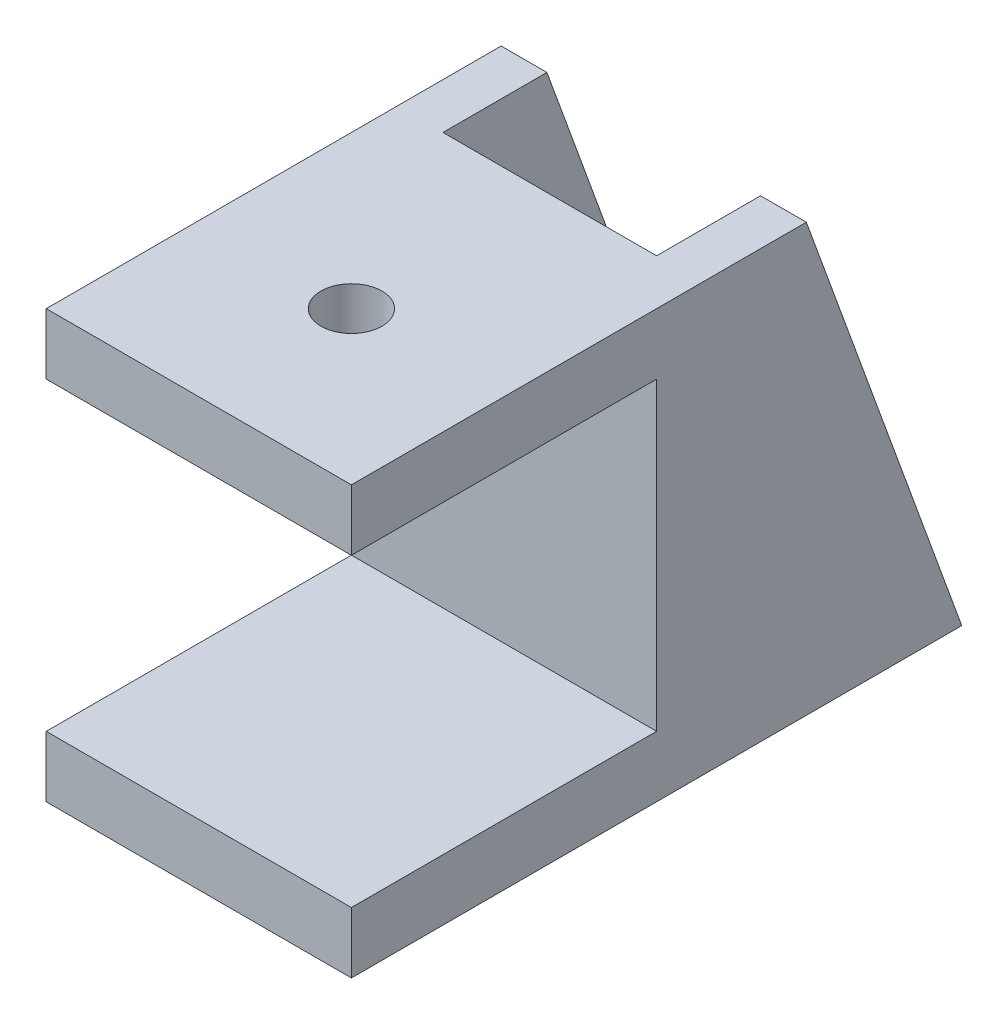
from build123d import *

# Parameters (mm, degrees)
BOSS_EXTRUDE3_DEPTH = 20
SKETCH13_R          = 2
CUT_EXTRUDE4_DEPTH  = 5
SKETCH15_W          = 14
SKETCH15_H          = 17
CUT_EXTRUDE6_DEPTH  = 22
CUT_EXTRUDE7_DEPTH  = 20


with BuildPart() as part:
    # Sketch7 → Boss-Extrude3 (new body)
    with BuildSketch(Plane(origin=(0, 0, 0), x_dir=(0, 0, -1), z_dir=(1, 0, 0))):
        Polygon((-29.812473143, 23.99), (-29.812473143, 19.99), (-9.812473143, 19.99), (-9.812473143, 0), (-29.812473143, 0), (-29.812473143, -4), (10.187526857, -4), (0, 23.99), align=None)
    extrude(amount=BOSS_EXTRUDE3_DEPTH)

    # Sketch13 → Cut-Extrude4 (cut)
    with BuildSketch(Plane(origin=(0, 23.99, 0), x_dir=(1, 0, 0), z_dir=(0, 1, 0))):
        with Locations(Location((10, -19.812473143, 0), (0, 0, 270))):
            Circle(SKETCH13_R)
    extrude(amount=-CUT_EXTRUDE4_DEPTH, mode=Mode.SUBTRACT)

    # Sketch15 → Cut-Extrude6 (cut)
    with BuildSketch(Plane(origin=(0, 23.99, 0), x_dir=(1, 0, 0), z_dir=(0, 1, 0))):
        with Locations((10, 1.687526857)):
            Rectangle(SKETCH15_W, SKETCH15_H)
    extrude(amount=-CUT_EXTRUDE6_DEPTH, mode=Mode.SUBTRACT)

    # Sketch16 → Cut-Extrude7 (cut)
    with BuildSketch(Plane(origin=(0, 1.99, 0), x_dir=(1, 0, 0), z_dir=(0, 1, 0))):
        with BuildLine():
            Line((13.1, 4.507345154), (13.1, -3.312473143))
            ThreePointArc((13.1, -3.312473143), (10, -6.412473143), (6.9, -3.312473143))
            Line((6.9, -3.312473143), (6.9, 4.507345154))
            ThreePointArc((6.9, 4.507345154), (10, 7.607345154), (13.1, 4.507345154))
        make_face()
    extrude(amount=-CUT_EXTRUDE7_DEPTH, mode=Mode.SUBTRACT)


solid = part.part
